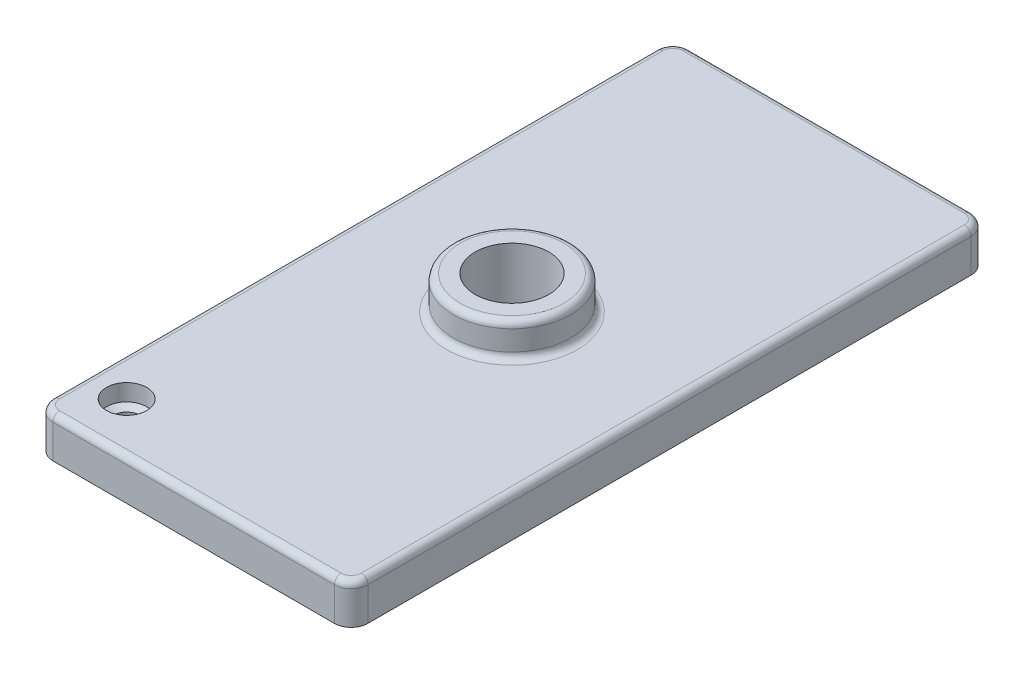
from build123d import *

# Parameters (mm, degrees)
SKETCH1_W         = 94
SKETCH1_H         = 190
PLATE_DEPTH       = 12
SKETCH2_R         = 17.5
BOSS_DEPTH        = 10
SKETCH3_R         = 11
CENTER_HOLE_DEPTH = 109.249711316
FILLET_R5_R       = 5
FILLET_R2_R       = 2


with BuildPart() as part:
    # Sketch1 → plate (new body)
    with BuildSketch(Plane(origin=(0, 0, 0), x_dir=(1, 0, 0), z_dir=(0, 1, 0))):
        Rectangle(SKETCH1_W, SKETCH1_H)
    extrude(amount=PLATE_DEPTH)

    # Sketch2 → boss (add)
    with BuildSketch(Plane(origin=(0, 12, 0), x_dir=(-1, 0, 0), z_dir=(0, 1, 0))):
        with Locations(Location((0, 0, 0), (0, 0, 270))):
            Circle(SKETCH2_R)
    extrude(amount=BOSS_DEPTH)

    # Sketch3 → center hole (cut, through all)
    with BuildSketch(Plane(origin=(0, 22, 0), x_dir=(-1, 0, 0), z_dir=(0, 1, 0))):
        with Locations(Location((0, 0, 0), (0, 0, 90))):
            Circle(SKETCH3_R)
    extrude(amount=-CENTER_HOLE_DEPTH, mode=Mode.SUBTRACT)

    # Sketch4 → pattern hole (revolve, cut)
    with BuildSketch(Plane(origin=(-35, 12, 80), x_dir=(0, 0, 1), z_dir=(1, 0, 0))):
        Polygon((0, 0), (0, 12), (4, 12), (4, 6.201721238), (6, 5), (6, 0), align=None)
    revolve(axis=Axis((-35, 18.130023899, 80), (0, -1, 0)), mode=Mode.SUBTRACT)

    # Fillet R5
    fillet_r5_edges = [part.edges().sort_by_distance(p)[0] for p in [
        (-47, 6, -95),
        (47, 6, -95),
        (47, 6, 95),
        (-47, 6, 95),
    ]]
    fillet(fillet_r5_edges, radius=FILLET_R5_R)

    # Fillet R2
    fillet_r2_edges = [part.edges().sort_by_distance(p)[0] for p in [
        (0, 12, 17.5),
        (0, 22, 17.5),
        (47, 12, 0),
        (0, 12, 95),
        (-47, 12, 0),
        (0, 12, -95),
        (45.535533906, 12, -93.535533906),
        (-45.535533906, 12, -93.535533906),
        (-45.535533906, 12, 93.535533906),
        (45.535533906, 12, 93.535533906),
    ]]
    fillet(fillet_r2_edges, radius=FILLET_R2_R)


solid = part.part
